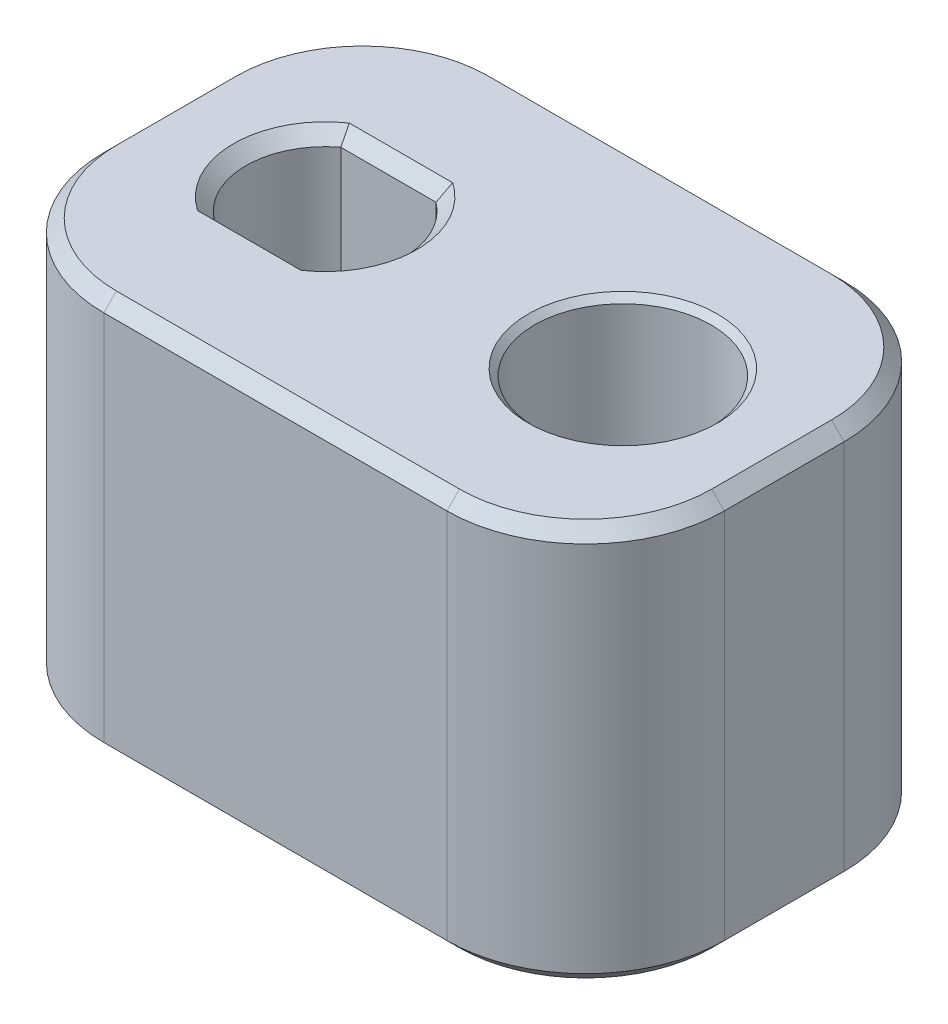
ISO-10303-21;
HEADER;
FILE_DESCRIPTION(('STEP AP214'),'2;1');
FILE_NAME('part.step','',(''),(''),'','','');
FILE_SCHEMA(('AUTOMOTIVE_DESIGN { 1 0 10303 214 1 1 1 1 }'));
ENDSEC;
DATA;
#1=APPLICATION_CONTEXT('core data for automotive mechanical design processes');
#2=APPLICATION_PROTOCOL_DEFINITION('international standard','automotive_design',2000,#1);
#3=PRODUCT_CONTEXT('',#1,'mechanical');
#4=PRODUCT('Part','Part','',(#3));
#5=PRODUCT_RELATED_PRODUCT_CATEGORY('part','',(#4));
#6=PRODUCT_DEFINITION_FORMATION('','',#4);
#7=PRODUCT_DEFINITION_CONTEXT('part definition',#1,'design');
#8=PRODUCT_DEFINITION('design','',#6,#7);
#9=PRODUCT_DEFINITION_SHAPE('','',#8);
#10=(LENGTH_UNIT() NAMED_UNIT(*) SI_UNIT(.MILLI.,.METRE.));
#11=(NAMED_UNIT(*) PLANE_ANGLE_UNIT() SI_UNIT($,.RADIAN.));
#12=(NAMED_UNIT(*) SI_UNIT($,.STERADIAN.) SOLID_ANGLE_UNIT());
#13=UNCERTAINTY_MEASURE_WITH_UNIT(LENGTH_MEASURE(1.E-05),#10,'distance_accuracy_value','');
#14=(GEOMETRIC_REPRESENTATION_CONTEXT(3) GLOBAL_UNCERTAINTY_ASSIGNED_CONTEXT((#13)) GLOBAL_UNIT_ASSIGNED_CONTEXT((#10,
#11,#12)) REPRESENTATION_CONTEXT('',''));
#15=CARTESIAN_POINT('',(0.,0.,0.));
#16=DIRECTION('',(0.,0.,1.));
#17=DIRECTION('',(1.,0.,0.));
#18=AXIS2_PLACEMENT_3D('',#15,#16,#17);
#19=CARTESIAN_POINT('',(12.4968,16.002,-8.001));
#20=DIRECTION('',(0.,-1.,0.));
#21=DIRECTION('',(0.,0.,-1.));
#22=AXIS2_PLACEMENT_3D('',#19,#20,#21);
#23=PLANE('',#22);
#24=CARTESIAN_POINT('',(6.9088,16.002,-2.413));
#25=DIRECTION('',(0.,-1.,0.));
#26=DIRECTION('',(0.,0.,-1.));
#27=AXIS2_PLACEMENT_3D('',#24,#25,#26);
#28=CIRCLE('',#27,5.08000000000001);
#29=CARTESIAN_POINT('',(11.9888,16.002,-2.413));
#30=VERTEX_POINT('',#29);
#31=CARTESIAN_POINT('',(6.9088,16.002,-7.493));
#32=VERTEX_POINT('',#31);
#33=EDGE_CURVE('E58',#30,#32,#28,.F.);
#34=ORIENTED_EDGE('',*,*,#33,.T.);
#35=DIRECTION('',(-1.,0.,0.));
#36=VECTOR('',#35,1.);
#37=CARTESIAN_POINT('',(12.4968,16.002,-7.493));
#38=LINE('',#37,#36);
#39=CARTESIAN_POINT('',(-6.9088,16.002,-7.493));
#40=VERTEX_POINT('',#39);
#41=EDGE_CURVE('E11',#32,#40,#38,.T.);
#42=ORIENTED_EDGE('',*,*,#41,.T.);
#43=CARTESIAN_POINT('',(-6.9088,16.002,-2.413));
#44=DIRECTION('',(0.,-1.,0.));
#45=DIRECTION('',(0.,0.,-1.));
#46=AXIS2_PLACEMENT_3D('',#43,#44,#45);
#47=CIRCLE('',#46,5.08000000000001);
#48=CARTESIAN_POINT('',(-11.9888,16.002,-2.413));
#49=VERTEX_POINT('',#48);
#50=EDGE_CURVE('E43',#40,#49,#47,.F.);
#51=ORIENTED_EDGE('',*,*,#50,.T.);
#52=DIRECTION('',(0.,0.,1.));
#53=VECTOR('',#52,1.);
#54=CARTESIAN_POINT('',(-11.9888,16.002,-8.001));
#55=LINE('',#54,#53);
#56=CARTESIAN_POINT('',(-11.9888,16.002,2.413));
#57=VERTEX_POINT('',#56);
#58=EDGE_CURVE('E404',#49,#57,#55,.T.);
#59=ORIENTED_EDGE('',*,*,#58,.T.);
#60=CARTESIAN_POINT('',(-6.9088,16.002,2.413));
#61=DIRECTION('',(0.,-1.,0.));
#62=DIRECTION('',(0.,0.,-1.));
#63=AXIS2_PLACEMENT_3D('',#60,#61,#62);
#64=CIRCLE('',#63,5.08000000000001);
#65=CARTESIAN_POINT('',(-6.9088,16.002,7.49300000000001));
#66=VERTEX_POINT('',#65);
#67=EDGE_CURVE('E400',#57,#66,#64,.F.);
#68=ORIENTED_EDGE('',*,*,#67,.T.);
#69=DIRECTION('',(1.,0.,0.));
#70=VECTOR('',#69,1.);
#71=CARTESIAN_POINT('',(12.4968,16.002,7.49300000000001));
#72=LINE('',#71,#70);
#73=CARTESIAN_POINT('',(6.9088,16.002,7.49300000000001));
#74=VERTEX_POINT('',#73);
#75=EDGE_CURVE('E396',#66,#74,#72,.T.);
#76=ORIENTED_EDGE('',*,*,#75,.T.);
#77=CARTESIAN_POINT('',(6.90879999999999,16.002,2.413));
#78=DIRECTION('',(0.,-1.,0.));
#79=DIRECTION('',(0.,0.,-1.));
#80=AXIS2_PLACEMENT_3D('',#77,#78,#79);
#81=CIRCLE('',#80,5.08000000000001);
#82=CARTESIAN_POINT('',(11.9888,16.002,2.413));
#83=VERTEX_POINT('',#82);
#84=EDGE_CURVE('E398',#74,#83,#81,.F.);
#85=ORIENTED_EDGE('',*,*,#84,.T.);
#86=DIRECTION('',(0.,0.,-1.));
#87=VECTOR('',#86,1.);
#88=CARTESIAN_POINT('',(11.9888,16.002,-8.001));
#89=LINE('',#88,#87);
#90=EDGE_CURVE('E402',#83,#30,#89,.T.);
#91=ORIENTED_EDGE('',*,*,#90,.T.);
#92=EDGE_LOOP('',(#34,#42,#51,#59,#68,#76,#85,#91));
#93=FACE_BOUND('',#92,.T.);
#94=DIRECTION('',(1.,0.,0.));
#95=VECTOR('',#94,1.);
#96=CARTESIAN_POINT('',(12.4968,16.002,-3.05435));
#97=LINE('',#96,#95);
#98=CARTESIAN_POINT('',(-8.07505964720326,16.002,-3.05435));
#99=VERTEX_POINT('',#98);
#100=CARTESIAN_POINT('',(-3.91374035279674,16.002,-3.05435));
#101=VERTEX_POINT('',#100);
#102=EDGE_CURVE('E239',#99,#101,#97,.T.);
#103=ORIENTED_EDGE('',*,*,#102,.T.);
#104=CARTESIAN_POINT('',(-5.9944,16.002,0.));
#105=DIRECTION('',(0.,-1.,0.));
#106=DIRECTION('',(0.,0.,-1.));
#107=AXIS2_PLACEMENT_3D('',#104,#105,#106);
#108=CIRCLE('',#107,3.6957);
#109=CARTESIAN_POINT('',(-3.91374035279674,16.002,3.05435));
#110=VERTEX_POINT('',#109);
#111=EDGE_CURVE('E251',#101,#110,#108,.T.);
#112=ORIENTED_EDGE('',*,*,#111,.T.);
#113=DIRECTION('',(-1.,0.,0.));
#114=VECTOR('',#113,1.);
#115=CARTESIAN_POINT('',(12.4968,16.002,3.05435));
#116=LINE('',#115,#114);
#117=CARTESIAN_POINT('',(-8.07505964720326,16.002,3.05435000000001));
#118=VERTEX_POINT('',#117);
#119=EDGE_CURVE('E249',#110,#118,#116,.T.);
#120=ORIENTED_EDGE('',*,*,#119,.T.);
#121=CARTESIAN_POINT('',(-5.9944,16.002,0.));
#122=DIRECTION('',(0.,-1.,0.));
#123=DIRECTION('',(0.,0.,-1.));
#124=AXIS2_PLACEMENT_3D('',#121,#122,#123);
#125=CIRCLE('',#124,3.6957);
#126=EDGE_CURVE('E247',#118,#99,#125,.T.);
#127=ORIENTED_EDGE('',*,*,#126,.T.);
#128=EDGE_LOOP('',(#103,#112,#120,#127));
#129=FACE_BOUND('',#128,.T.);
#130=CARTESIAN_POINT('',(5.9944,16.002,0.));
#131=DIRECTION('',(0.,-1.,0.));
#132=DIRECTION('',(0.,0.,-1.));
#133=AXIS2_PLACEMENT_3D('',#130,#131,#132);
#134=CIRCLE('',#133,3.81);
#135=CARTESIAN_POINT('',(5.9944,16.002,-3.81));
#136=VERTEX_POINT('',#135);
#137=EDGE_CURVE('E495',#136,#136,#134,.T.);
#138=ORIENTED_EDGE('',*,*,#137,.T.);
#139=EDGE_LOOP('',(#138));
#140=FACE_BOUND('',#139,.T.);
#141=ADVANCED_FACE('F34',(#93,#129,#140),#23,.F.);
#142=CARTESIAN_POINT('',(12.4968,0.,-8.001));
#143=DIRECTION('',(0.,-1.,0.));
#144=DIRECTION('',(0.,0.,-1.));
#145=AXIS2_PLACEMENT_3D('',#142,#143,#144);
#146=PLANE('',#145);
#147=CARTESIAN_POINT('',(-6.9088,0.,-2.413));
#148=DIRECTION('',(0.,-1.,0.));
#149=DIRECTION('',(0.,0.,-1.));
#150=AXIS2_PLACEMENT_3D('',#147,#148,#149);
#151=CIRCLE('',#150,5.08);
#152=CARTESIAN_POINT('',(-11.9888,0.,-2.413));
#153=VERTEX_POINT('',#152);
#154=CARTESIAN_POINT('',(-6.9088,0.,-7.493));
#155=VERTEX_POINT('',#154);
#156=EDGE_CURVE('E363',#153,#155,#151,.T.);
#157=ORIENTED_EDGE('',*,*,#156,.T.);
#158=DIRECTION('',(1.,0.,0.));
#159=VECTOR('',#158,1.);
#160=CARTESIAN_POINT('',(6.9088,0.,-7.493));
#161=LINE('',#160,#159);
#162=CARTESIAN_POINT('',(6.9088,0.,-7.493));
#163=VERTEX_POINT('',#162);
#164=EDGE_CURVE('E365',#155,#163,#161,.T.);
#165=ORIENTED_EDGE('',*,*,#164,.T.);
#166=CARTESIAN_POINT('',(6.9088,0.,-2.413));
#167=DIRECTION('',(0.,-1.,0.));
#168=DIRECTION('',(0.,0.,-1.));
#169=AXIS2_PLACEMENT_3D('',#166,#167,#168);
#170=CIRCLE('',#169,5.08);
#171=CARTESIAN_POINT('',(11.9888,0.,-2.413));
#172=VERTEX_POINT('',#171);
#173=EDGE_CURVE('E361',#163,#172,#170,.T.);
#174=ORIENTED_EDGE('',*,*,#173,.T.);
#175=DIRECTION('',(0.,0.,1.));
#176=VECTOR('',#175,1.);
#177=CARTESIAN_POINT('',(11.9888,0.,2.413));
#178=LINE('',#177,#176);
#179=CARTESIAN_POINT('',(11.9888,0.,2.413));
#180=VERTEX_POINT('',#179);
#181=EDGE_CURVE('E357',#172,#180,#178,.T.);
#182=ORIENTED_EDGE('',*,*,#181,.T.);
#183=CARTESIAN_POINT('',(6.90879999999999,0.,2.413));
#184=DIRECTION('',(0.,-1.,0.));
#185=DIRECTION('',(0.,0.,-1.));
#186=AXIS2_PLACEMENT_3D('',#183,#184,#185);
#187=CIRCLE('',#186,5.08);
#188=CARTESIAN_POINT('',(6.9088,0.,7.493));
#189=VERTEX_POINT('',#188);
#190=EDGE_CURVE('E353',#180,#189,#187,.T.);
#191=ORIENTED_EDGE('',*,*,#190,.T.);
#192=DIRECTION('',(-1.,0.,0.));
#193=VECTOR('',#192,1.);
#194=CARTESIAN_POINT('',(-6.9088,0.,7.493));
#195=LINE('',#194,#193);
#196=CARTESIAN_POINT('',(-6.9088,0.,7.493));
#197=VERTEX_POINT('',#196);
#198=EDGE_CURVE('E351',#189,#197,#195,.T.);
#199=ORIENTED_EDGE('',*,*,#198,.T.);
#200=CARTESIAN_POINT('',(-6.9088,0.,2.413));
#201=DIRECTION('',(0.,-1.,0.));
#202=DIRECTION('',(0.,0.,-1.));
#203=AXIS2_PLACEMENT_3D('',#200,#201,#202);
#204=CIRCLE('',#203,5.08);
#205=CARTESIAN_POINT('',(-11.9888,0.,2.413));
#206=VERTEX_POINT('',#205);
#207=EDGE_CURVE('E355',#197,#206,#204,.T.);
#208=ORIENTED_EDGE('',*,*,#207,.T.);
#209=DIRECTION('',(0.,0.,-1.));
#210=VECTOR('',#209,1.);
#211=CARTESIAN_POINT('',(-11.9888,0.,-2.413));
#212=LINE('',#211,#210);
#213=EDGE_CURVE('E359',#206,#153,#212,.T.);
#214=ORIENTED_EDGE('',*,*,#213,.T.);
#215=EDGE_LOOP('',(#157,#165,#174,#182,#191,#199,#208,#214));
#216=FACE_BOUND('',#215,.T.);
#217=CARTESIAN_POINT('',(-5.9944,0.,0.));
#218=DIRECTION('',(0.,-1.,0.));
#219=DIRECTION('',(0.,0.,-1.));
#220=AXIS2_PLACEMENT_3D('',#217,#218,#219);
#221=CIRCLE('',#220,3.6957);
#222=CARTESIAN_POINT('',(-8.07505964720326,0.,-3.05435));
#223=VERTEX_POINT('',#222);
#224=CARTESIAN_POINT('',(-8.07505964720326,0.,3.05435));
#225=VERTEX_POINT('',#224);
#226=EDGE_CURVE('E264',#223,#225,#221,.F.);
#227=ORIENTED_EDGE('',*,*,#226,.T.);
#228=DIRECTION('',(1.,0.,0.));
#229=VECTOR('',#228,1.);
#230=CARTESIAN_POINT('',(-4.07671051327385,0.,3.05435));
#231=LINE('',#230,#229);
#232=CARTESIAN_POINT('',(-3.91374035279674,0.,3.05435));
#233=VERTEX_POINT('',#232);
#234=EDGE_CURVE('E268',#225,#233,#231,.T.);
#235=ORIENTED_EDGE('',*,*,#234,.T.);
#236=CARTESIAN_POINT('',(-5.9944,0.,0.));
#237=DIRECTION('',(0.,-1.,0.));
#238=DIRECTION('',(0.,0.,-1.));
#239=AXIS2_PLACEMENT_3D('',#236,#237,#238);
#240=CIRCLE('',#239,3.6957);
#241=CARTESIAN_POINT('',(-3.91374035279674,0.,-3.05435));
#242=VERTEX_POINT('',#241);
#243=EDGE_CURVE('E266',#233,#242,#240,.F.);
#244=ORIENTED_EDGE('',*,*,#243,.T.);
#245=DIRECTION('',(-1.,0.,0.));
#246=VECTOR('',#245,1.);
#247=CARTESIAN_POINT('',(-7.91208948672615,0.,-3.05435));
#248=LINE('',#247,#246);
#249=EDGE_CURVE('E228',#242,#223,#248,.T.);
#250=ORIENTED_EDGE('',*,*,#249,.T.);
#251=EDGE_LOOP('',(#227,#235,#244,#250));
#252=FACE_BOUND('',#251,.T.);
#253=CARTESIAN_POINT('',(5.9944,0.,0.));
#254=DIRECTION('',(0.,-1.,0.));
#255=DIRECTION('',(0.,0.,-1.));
#256=AXIS2_PLACEMENT_3D('',#253,#254,#255);
#257=CIRCLE('',#256,5.6642);
#258=CARTESIAN_POINT('',(5.9944,0.,-5.6642));
#259=VERTEX_POINT('',#258);
#260=EDGE_CURVE('E430',#259,#259,#257,.T.);
#261=ORIENTED_EDGE('',*,*,#260,.F.);
#262=EDGE_LOOP('',(#261));
#263=FACE_BOUND('',#262,.T.);
#264=ADVANCED_FACE('F516',(#216,#252,#263),#146,.T.);
#265=CARTESIAN_POINT('',(12.4968,16.002,8.001));
#266=DIRECTION('',(-1.,0.,0.));
#267=DIRECTION('',(0.,0.,1.));
#268=AXIS2_PLACEMENT_3D('',#265,#266,#267);
#269=PLANE('',#268);
#270=DIRECTION('',(0.,-1.,0.));
#271=VECTOR('',#270,1.);
#272=CARTESIAN_POINT('',(12.4968,16.002,2.413));
#273=LINE('',#272,#271);
#274=CARTESIAN_POINT('',(12.4968,15.494,2.413));
#275=VERTEX_POINT('',#274);
#276=CARTESIAN_POINT('',(12.4968,0.507999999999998,2.413));
#277=VERTEX_POINT('',#276);
#278=EDGE_CURVE('E242',#275,#277,#273,.T.);
#279=ORIENTED_EDGE('',*,*,#278,.T.);
#280=DIRECTION('',(0.,0.,-1.));
#281=VECTOR('',#280,1.);
#282=CARTESIAN_POINT('',(12.4968,0.507999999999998,-2.413));
#283=LINE('',#282,#281);
#284=CARTESIAN_POINT('',(12.4968,0.507999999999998,-2.413));
#285=VERTEX_POINT('',#284);
#286=EDGE_CURVE('E382',#277,#285,#283,.T.);
#287=ORIENTED_EDGE('',*,*,#286,.T.);
#288=DIRECTION('',(0.,-1.,0.));
#289=VECTOR('',#288,1.);
#290=CARTESIAN_POINT('',(12.4968,16.002,-2.413));
#291=LINE('',#290,#289);
#292=CARTESIAN_POINT('',(12.4968,15.494,-2.413));
#293=VERTEX_POINT('',#292);
#294=EDGE_CURVE('E237',#285,#293,#291,.F.);
#295=ORIENTED_EDGE('',*,*,#294,.T.);
#296=DIRECTION('',(0.,0.,1.));
#297=VECTOR('',#296,1.);
#298=CARTESIAN_POINT('',(12.4968,15.494,8.001));
#299=LINE('',#298,#297);
#300=EDGE_CURVE('E380',#293,#275,#299,.T.);
#301=ORIENTED_EDGE('',*,*,#300,.T.);
#302=EDGE_LOOP('',(#279,#287,#295,#301));
#303=FACE_BOUND('',#302,.T.);
#304=ADVANCED_FACE('F518',(#303),#269,.F.);
#305=CARTESIAN_POINT('',(-12.4968,16.002,-8.001));
#306=DIRECTION('',(0.,0.,1.));
#307=DIRECTION('',(1.,0.,0.));
#308=AXIS2_PLACEMENT_3D('',#305,#306,#307);
#309=PLANE('',#308);
#310=DIRECTION('',(0.,-1.,0.));
#311=VECTOR('',#310,1.);
#312=CARTESIAN_POINT('',(6.9088,16.002,-8.001));
#313=LINE('',#312,#311);
#314=CARTESIAN_POINT('',(6.9088,15.494,-8.001));
#315=VERTEX_POINT('',#314);
#316=CARTESIAN_POINT('',(6.9088,0.507999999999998,-8.001));
#317=VERTEX_POINT('',#316);
#318=EDGE_CURVE('E482',#315,#317,#313,.T.);
#319=ORIENTED_EDGE('',*,*,#318,.T.);
#320=DIRECTION('',(-1.,0.,0.));
#321=VECTOR('',#320,1.);
#322=CARTESIAN_POINT('',(-6.9088,0.507999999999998,-8.001));
#323=LINE('',#322,#321);
#324=CARTESIAN_POINT('',(-6.9088,0.507999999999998,-8.001));
#325=VERTEX_POINT('',#324);
#326=EDGE_CURVE('E348',#317,#325,#323,.T.);
#327=ORIENTED_EDGE('',*,*,#326,.T.);
#328=DIRECTION('',(0.,-1.,0.));
#329=VECTOR('',#328,1.);
#330=CARTESIAN_POINT('',(-6.9088,16.002,-8.001));
#331=LINE('',#330,#329);
#332=CARTESIAN_POINT('',(-6.9088,15.494,-8.001));
#333=VERTEX_POINT('',#332);
#334=EDGE_CURVE('E477',#325,#333,#331,.F.);
#335=ORIENTED_EDGE('',*,*,#334,.T.);
#336=DIRECTION('',(1.,0.,0.));
#337=VECTOR('',#336,1.);
#338=CARTESIAN_POINT('',(-12.4968,15.494,-8.001));
#339=LINE('',#338,#337);
#340=EDGE_CURVE('E271',#333,#315,#339,.T.);
#341=ORIENTED_EDGE('',*,*,#340,.T.);
#342=EDGE_LOOP('',(#319,#327,#335,#341));
#343=FACE_BOUND('',#342,.T.);
#344=ADVANCED_FACE('F525',(#343),#309,.F.);
#345=CARTESIAN_POINT('',(-12.4968,16.002,8.001));
#346=DIRECTION('',(1.,0.,0.));
#347=DIRECTION('',(0.,0.,-1.));
#348=AXIS2_PLACEMENT_3D('',#345,#346,#347);
#349=PLANE('',#348);
#350=DIRECTION('',(0.,-1.,0.));
#351=VECTOR('',#350,1.);
#352=CARTESIAN_POINT('',(-12.4968,16.002,-2.413));
#353=LINE('',#352,#351);
#354=CARTESIAN_POINT('',(-12.4968,15.494,-2.413));
#355=VERTEX_POINT('',#354);
#356=CARTESIAN_POINT('',(-12.4968,0.507999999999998,-2.413));
#357=VERTEX_POINT('',#356);
#358=EDGE_CURVE('E485',#355,#357,#353,.T.);
#359=ORIENTED_EDGE('',*,*,#358,.T.);
#360=DIRECTION('',(0.,0.,1.));
#361=VECTOR('',#360,1.);
#362=CARTESIAN_POINT('',(-12.4968,0.507999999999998,2.413));
#363=LINE('',#362,#361);
#364=CARTESIAN_POINT('',(-12.4968,0.507999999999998,2.413));
#365=VERTEX_POINT('',#364);
#366=EDGE_CURVE('E378',#357,#365,#363,.T.);
#367=ORIENTED_EDGE('',*,*,#366,.T.);
#368=DIRECTION('',(0.,-1.,0.));
#369=VECTOR('',#368,1.);
#370=CARTESIAN_POINT('',(-12.4968,16.002,2.413));
#371=LINE('',#370,#369);
#372=CARTESIAN_POINT('',(-12.4968,15.494,2.413));
#373=VERTEX_POINT('',#372);
#374=EDGE_CURVE('E488',#365,#373,#371,.F.);
#375=ORIENTED_EDGE('',*,*,#374,.T.);
#376=DIRECTION('',(0.,0.,-1.));
#377=VECTOR('',#376,1.);
#378=CARTESIAN_POINT('',(-12.4968,15.494,8.001));
#379=LINE('',#378,#377);
#380=EDGE_CURVE('E376',#373,#355,#379,.T.);
#381=ORIENTED_EDGE('',*,*,#380,.T.);
#382=EDGE_LOOP('',(#359,#367,#375,#381));
#383=FACE_BOUND('',#382,.T.);
#384=ADVANCED_FACE('F535',(#383),#349,.F.);
#385=CARTESIAN_POINT('',(-12.4968,16.002,8.001));
#386=DIRECTION('',(0.,0.,-1.));
#387=DIRECTION('',(-1.,0.,0.));
#388=AXIS2_PLACEMENT_3D('',#385,#386,#387);
#389=PLANE('',#388);
#390=DIRECTION('',(0.,-1.,0.));
#391=VECTOR('',#390,1.);
#392=CARTESIAN_POINT('',(-6.9088,16.002,8.001));
#393=LINE('',#392,#391);
#394=CARTESIAN_POINT('',(-6.9088,15.494,8.001));
#395=VERTEX_POINT('',#394);
#396=CARTESIAN_POINT('',(-6.9088,0.507999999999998,8.001));
#397=VERTEX_POINT('',#396);
#398=EDGE_CURVE('E466',#395,#397,#393,.T.);
#399=ORIENTED_EDGE('',*,*,#398,.T.);
#400=DIRECTION('',(1.,0.,0.));
#401=VECTOR('',#400,1.);
#402=CARTESIAN_POINT('',(6.9088,0.507999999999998,8.001));
#403=LINE('',#402,#401);
#404=CARTESIAN_POINT('',(6.9088,0.507999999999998,8.001));
#405=VERTEX_POINT('',#404);
#406=EDGE_CURVE('E394',#397,#405,#403,.T.);
#407=ORIENTED_EDGE('',*,*,#406,.T.);
#408=DIRECTION('',(0.,-1.,0.));
#409=VECTOR('',#408,1.);
#410=CARTESIAN_POINT('',(6.9088,16.002,8.001));
#411=LINE('',#410,#409);
#412=CARTESIAN_POINT('',(6.9088,15.494,8.001));
#413=VERTEX_POINT('',#412);
#414=EDGE_CURVE('E469',#405,#413,#411,.F.);
#415=ORIENTED_EDGE('',*,*,#414,.T.);
#416=DIRECTION('',(-1.,0.,0.));
#417=VECTOR('',#416,1.);
#418=CARTESIAN_POINT('',(-12.4968,15.494,8.001));
#419=LINE('',#418,#417);
#420=EDGE_CURVE('E392',#413,#395,#419,.T.);
#421=ORIENTED_EDGE('',*,*,#420,.T.);
#422=EDGE_LOOP('',(#399,#407,#415,#421));
#423=FACE_BOUND('',#422,.T.);
#424=ADVANCED_FACE('F465',(#423),#389,.F.);
#425=CARTESIAN_POINT('',(-6.9088,16.002,-2.413));
#426=DIRECTION('',(0.,-1.,0.));
#427=DIRECTION('',(0.,0.,-1.));
#428=AXIS2_PLACEMENT_3D('',#425,#426,#427);
#429=CYLINDRICAL_SURFACE('',#428,5.588);
#430=ORIENTED_EDGE('',*,*,#334,.F.);
#431=CARTESIAN_POINT('',(-6.9088,0.507999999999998,-2.413));
#432=DIRECTION('',(0.,-1.,0.));
#433=DIRECTION('',(0.,0.,-1.));
#434=AXIS2_PLACEMENT_3D('',#431,#432,#433);
#435=CIRCLE('',#434,5.588);
#436=EDGE_CURVE('E370',#325,#357,#435,.F.);
#437=ORIENTED_EDGE('',*,*,#436,.T.);
#438=ORIENTED_EDGE('',*,*,#358,.F.);
#439=CARTESIAN_POINT('',(-6.9088,15.494,-2.413));
#440=DIRECTION('',(0.,-1.,0.));
#441=DIRECTION('',(0.,0.,-1.));
#442=AXIS2_PLACEMENT_3D('',#439,#440,#441);
#443=CIRCLE('',#442,5.588);
#444=EDGE_CURVE('E368',#355,#333,#443,.T.);
#445=ORIENTED_EDGE('',*,*,#444,.T.);
#446=EDGE_LOOP('',(#430,#437,#438,#445));
#447=FACE_BOUND('',#446,.T.);
#448=ADVANCED_FACE('F534',(#447),#429,.T.);
#449=CARTESIAN_POINT('',(-6.9088,16.002,2.413));
#450=DIRECTION('',(0.,-1.,0.));
#451=DIRECTION('',(0.,0.,-1.));
#452=AXIS2_PLACEMENT_3D('',#449,#450,#451);
#453=CYLINDRICAL_SURFACE('',#452,5.588);
#454=ORIENTED_EDGE('',*,*,#374,.F.);
#455=CARTESIAN_POINT('',(-6.9088,0.507999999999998,2.413));
#456=DIRECTION('',(0.,-1.,0.));
#457=DIRECTION('',(0.,0.,-1.));
#458=AXIS2_PLACEMENT_3D('',#455,#456,#457);
#459=CIRCLE('',#458,5.588);
#460=EDGE_CURVE('E386',#365,#397,#459,.F.);
#461=ORIENTED_EDGE('',*,*,#460,.T.);
#462=ORIENTED_EDGE('',*,*,#398,.F.);
#463=CARTESIAN_POINT('',(-6.9088,15.494,2.413));
#464=DIRECTION('',(0.,-1.,0.));
#465=DIRECTION('',(0.,0.,-1.));
#466=AXIS2_PLACEMENT_3D('',#463,#464,#465);
#467=CIRCLE('',#466,5.588);
#468=EDGE_CURVE('E384',#395,#373,#467,.T.);
#469=ORIENTED_EDGE('',*,*,#468,.T.);
#470=EDGE_LOOP('',(#454,#461,#462,#469));
#471=FACE_BOUND('',#470,.T.);
#472=ADVANCED_FACE('F472',(#471),#453,.T.);
#473=CARTESIAN_POINT('',(6.9088,16.002,-2.413));
#474=DIRECTION('',(0.,-1.,0.));
#475=DIRECTION('',(0.,0.,-1.));
#476=AXIS2_PLACEMENT_3D('',#473,#474,#475);
#477=CYLINDRICAL_SURFACE('',#476,5.588);
#478=ORIENTED_EDGE('',*,*,#294,.F.);
#479=CARTESIAN_POINT('',(6.9088,0.507999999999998,-2.413));
#480=DIRECTION('',(0.,-1.,0.));
#481=DIRECTION('',(0.,0.,-1.));
#482=AXIS2_PLACEMENT_3D('',#479,#480,#481);
#483=CIRCLE('',#482,5.588);
#484=EDGE_CURVE('E374',#285,#317,#483,.F.);
#485=ORIENTED_EDGE('',*,*,#484,.T.);
#486=ORIENTED_EDGE('',*,*,#318,.F.);
#487=CARTESIAN_POINT('',(6.9088,15.494,-2.413));
#488=DIRECTION('',(0.,-1.,0.));
#489=DIRECTION('',(0.,0.,-1.));
#490=AXIS2_PLACEMENT_3D('',#487,#488,#489);
#491=CIRCLE('',#490,5.588);
#492=EDGE_CURVE('E372',#315,#293,#491,.T.);
#493=ORIENTED_EDGE('',*,*,#492,.T.);
#494=EDGE_LOOP('',(#478,#485,#486,#493));
#495=FACE_BOUND('',#494,.T.);
#496=ADVANCED_FACE('F547',(#495),#477,.T.);
#497=CARTESIAN_POINT('',(6.90879999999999,16.002,2.413));
#498=DIRECTION('',(0.,-1.,0.));
#499=DIRECTION('',(0.,0.,-1.));
#500=AXIS2_PLACEMENT_3D('',#497,#498,#499);
#501=CYLINDRICAL_SURFACE('',#500,5.588);
#502=ORIENTED_EDGE('',*,*,#414,.F.);
#503=CARTESIAN_POINT('',(6.90879999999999,0.507999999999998,2.413));
#504=DIRECTION('',(0.,-1.,0.));
#505=DIRECTION('',(0.,0.,-1.));
#506=AXIS2_PLACEMENT_3D('',#503,#504,#505);
#507=CIRCLE('',#506,5.588);
#508=EDGE_CURVE('E390',#405,#277,#507,.F.);
#509=ORIENTED_EDGE('',*,*,#508,.T.);
#510=ORIENTED_EDGE('',*,*,#278,.F.);
#511=CARTESIAN_POINT('',(6.90879999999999,15.494,2.413));
#512=DIRECTION('',(0.,-1.,0.));
#513=DIRECTION('',(0.,0.,-1.));
#514=AXIS2_PLACEMENT_3D('',#511,#512,#513);
#515=CIRCLE('',#514,5.588);
#516=EDGE_CURVE('E388',#275,#413,#515,.T.);
#517=ORIENTED_EDGE('',*,*,#516,.T.);
#518=EDGE_LOOP('',(#502,#509,#510,#517));
#519=FACE_BOUND('',#518,.T.);
#520=ADVANCED_FACE('F549',(#519),#501,.T.);
#521=CARTESIAN_POINT('',(-5.9944,0.,0.));
#522=DIRECTION('',(0.,1.,0.));
#523=DIRECTION('',(0.,0.,1.));
#524=AXIS2_PLACEMENT_3D('',#521,#522,#523);
#525=CYLINDRICAL_SURFACE('',#524,3.1877);
#526=DIRECTION('',(0.,1.,0.));
#527=VECTOR('',#526,1.);
#528=CARTESIAN_POINT('',(-7.91208948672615,0.,-2.54635));
#529=LINE('',#528,#527);
#530=CARTESIAN_POINT('',(-7.91208948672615,0.508000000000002,-2.54635));
#531=VERTEX_POINT('',#530);
#532=CARTESIAN_POINT('',(-7.91208948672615,15.494,-2.54635));
#533=VERTEX_POINT('',#532);
#534=EDGE_CURVE('E205',#531,#533,#529,.T.);
#535=ORIENTED_EDGE('',*,*,#534,.T.);
#536=CARTESIAN_POINT('',(-5.9944,15.494,0.));
#537=DIRECTION('',(0.,-1.,0.));
#538=DIRECTION('',(0.,0.,-1.));
#539=AXIS2_PLACEMENT_3D('',#536,#537,#538);
#540=CIRCLE('',#539,3.1877);
#541=CARTESIAN_POINT('',(-7.91208948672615,15.494,2.54635));
#542=VERTEX_POINT('',#541);
#543=EDGE_CURVE('E211',#533,#542,#540,.F.);
#544=ORIENTED_EDGE('',*,*,#543,.T.);
#545=DIRECTION('',(0.,1.,0.));
#546=VECTOR('',#545,1.);
#547=CARTESIAN_POINT('',(-7.91208948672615,0.,2.54635));
#548=LINE('',#547,#546);
#549=CARTESIAN_POINT('',(-7.91208948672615,0.508000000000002,2.54635));
#550=VERTEX_POINT('',#549);
#551=EDGE_CURVE('E490',#550,#542,#548,.T.);
#552=ORIENTED_EDGE('',*,*,#551,.F.);
#553=CARTESIAN_POINT('',(-5.9944,0.508000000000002,0.));
#554=DIRECTION('',(0.,-1.,0.));
#555=DIRECTION('',(0.,0.,-1.));
#556=AXIS2_PLACEMENT_3D('',#553,#554,#555);
#557=CIRCLE('',#556,3.1877);
#558=EDGE_CURVE('E259',#550,#531,#557,.T.);
#559=ORIENTED_EDGE('',*,*,#558,.T.);
#560=EDGE_LOOP('',(#535,#544,#552,#559));
#561=FACE_BOUND('',#560,.T.);
#562=ADVANCED_FACE('F552',(#561),#525,.F.);
#563=CARTESIAN_POINT('',(-7.91208948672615,0.,-2.54635));
#564=DIRECTION('',(0.,0.,-1.));
#565=DIRECTION('',(-1.,0.,0.));
#566=AXIS2_PLACEMENT_3D('',#563,#564,#565);
#567=PLANE('',#566);
#568=DIRECTION('',(0.,1.,0.));
#569=VECTOR('',#568,1.);
#570=CARTESIAN_POINT('',(-4.07671051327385,0.,-2.54635));
#571=LINE('',#570,#569);
#572=CARTESIAN_POINT('',(-4.07671051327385,0.508000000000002,-2.54635));
#573=VERTEX_POINT('',#572);
#574=CARTESIAN_POINT('',(-4.07671051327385,15.494,-2.54635));
#575=VERTEX_POINT('',#574);
#576=EDGE_CURVE('E203',#573,#575,#571,.T.);
#577=ORIENTED_EDGE('',*,*,#576,.T.);
#578=DIRECTION('',(-1.,0.,0.));
#579=VECTOR('',#578,1.);
#580=CARTESIAN_POINT('',(-7.91208948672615,15.494,-2.54635));
#581=LINE('',#580,#579);
#582=EDGE_CURVE('E210',#575,#533,#581,.T.);
#583=ORIENTED_EDGE('',*,*,#582,.T.);
#584=ORIENTED_EDGE('',*,*,#534,.F.);
#585=DIRECTION('',(1.,0.,0.));
#586=VECTOR('',#585,1.);
#587=CARTESIAN_POINT('',(-4.07671051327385,0.508000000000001,-2.54635));
#588=LINE('',#587,#586);
#589=EDGE_CURVE('E200',#531,#573,#588,.T.);
#590=ORIENTED_EDGE('',*,*,#589,.T.);
#591=EDGE_LOOP('',(#577,#583,#584,#590));
#592=FACE_BOUND('',#591,.T.);
#593=ADVANCED_FACE('F202',(#592),#567,.F.);
#594=CARTESIAN_POINT('',(-5.9944,0.,0.));
#595=DIRECTION('',(0.,1.,0.));
#596=DIRECTION('',(0.,0.,1.));
#597=AXIS2_PLACEMENT_3D('',#594,#595,#596);
#598=CYLINDRICAL_SURFACE('',#597,3.1877);
#599=DIRECTION('',(0.,1.,0.));
#600=VECTOR('',#599,1.);
#601=CARTESIAN_POINT('',(-4.07671051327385,0.,2.54635));
#602=LINE('',#601,#600);
#603=CARTESIAN_POINT('',(-4.07671051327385,0.508000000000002,2.54635));
#604=VERTEX_POINT('',#603);
#605=CARTESIAN_POINT('',(-4.07671051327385,15.494,2.54635));
#606=VERTEX_POINT('',#605);
#607=EDGE_CURVE('E222',#604,#606,#602,.T.);
#608=ORIENTED_EDGE('',*,*,#607,.T.);
#609=CARTESIAN_POINT('',(-5.9944,15.494,0.));
#610=DIRECTION('',(0.,-1.,0.));
#611=DIRECTION('',(0.,0.,-1.));
#612=AXIS2_PLACEMENT_3D('',#609,#610,#611);
#613=CIRCLE('',#612,3.1877);
#614=EDGE_CURVE('E221',#606,#575,#613,.F.);
#615=ORIENTED_EDGE('',*,*,#614,.T.);
#616=ORIENTED_EDGE('',*,*,#576,.F.);
#617=CARTESIAN_POINT('',(-5.9944,0.508000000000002,0.));
#618=DIRECTION('',(0.,-1.,0.));
#619=DIRECTION('',(0.,0.,-1.));
#620=AXIS2_PLACEMENT_3D('',#617,#618,#619);
#621=CIRCLE('',#620,3.1877);
#622=EDGE_CURVE('E218',#573,#604,#621,.T.);
#623=ORIENTED_EDGE('',*,*,#622,.T.);
#624=EDGE_LOOP('',(#608,#615,#616,#623));
#625=FACE_BOUND('',#624,.T.);
#626=ADVANCED_FACE('F216',(#625),#598,.F.);
#627=CARTESIAN_POINT('',(-7.91208948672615,0.,2.54635));
#628=DIRECTION('',(0.,0.,1.));
#629=DIRECTION('',(1.,0.,0.));
#630=AXIS2_PLACEMENT_3D('',#627,#628,#629);
#631=PLANE('',#630);
#632=ORIENTED_EDGE('',*,*,#551,.T.);
#633=DIRECTION('',(1.,0.,0.));
#634=VECTOR('',#633,1.);
#635=CARTESIAN_POINT('',(-7.91208948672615,15.494,2.54635));
#636=LINE('',#635,#634);
#637=EDGE_CURVE('E257',#542,#606,#636,.T.);
#638=ORIENTED_EDGE('',*,*,#637,.T.);
#639=ORIENTED_EDGE('',*,*,#607,.F.);
#640=DIRECTION('',(-1.,0.,0.));
#641=VECTOR('',#640,1.);
#642=CARTESIAN_POINT('',(-7.91208948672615,0.508000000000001,2.54635));
#643=LINE('',#642,#641);
#644=EDGE_CURVE('E254',#604,#550,#643,.T.);
#645=ORIENTED_EDGE('',*,*,#644,.T.);
#646=EDGE_LOOP('',(#632,#638,#639,#645));
#647=FACE_BOUND('',#646,.T.);
#648=ADVANCED_FACE('F311',(#647),#631,.F.);
#649=CARTESIAN_POINT('',(-5.9944,15.494,0.));
#650=DIRECTION('',(0.,1.,0.));
#651=DIRECTION('',(0.,0.,1.));
#652=AXIS2_PLACEMENT_3D('',#649,#650,#651);
#653=CONICAL_SURFACE('',#652,3.1877,0.785398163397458);
#654=CARTESIAN_POINT('',(-8.07505964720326,16.002,-3.05435));
#655=CARTESIAN_POINT('',(-8.04895050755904,15.9171646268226,-2.96951462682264));
#656=CARTESIAN_POINT('',(-8.02231511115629,15.8324136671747,-2.8847636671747));
#657=CARTESIAN_POINT('',(-7.96799172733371,15.6630803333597,-2.71543033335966));
#658=CARTESIAN_POINT('',(-7.94030373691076,15.5784979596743,-2.63084795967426));
#659=CARTESIAN_POINT('',(-7.91208948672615,15.494,-2.54635));
#660=B_SPLINE_CURVE_WITH_KNOTS('',3,(#654,#655,#656,#657,#658,#659),.UNSPECIFIED.,.F.,.F.,(4,2,
4),(0.,0.368339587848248,0.736680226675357),.UNSPECIFIED.);
#661=EDGE_CURVE('E296',#99,#533,#660,.T.);
#662=ORIENTED_EDGE('',*,*,#661,.F.);
#663=ORIENTED_EDGE('',*,*,#126,.F.);
#664=CARTESIAN_POINT('',(-8.07505964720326,16.002,3.05435000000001));
#665=CARTESIAN_POINT('',(-8.04895050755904,15.9171646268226,2.96951462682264));
#666=CARTESIAN_POINT('',(-8.02231511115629,15.8324136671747,2.8847636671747));
#667=CARTESIAN_POINT('',(-7.96799172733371,15.6630803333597,2.71543033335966));
#668=CARTESIAN_POINT('',(-7.94030373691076,15.5784979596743,2.63084795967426));
#669=CARTESIAN_POINT('',(-7.91208948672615,15.494,2.54635));
#670=B_SPLINE_CURVE_WITH_KNOTS('',3,(#664,#665,#666,#667,#668,#669),.UNSPECIFIED.,.F.,.F.,(4,2,
4),(0.,0.368339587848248,0.736680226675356),.UNSPECIFIED.);
#671=EDGE_CURVE('E302',#542,#118,#670,.F.);
#672=ORIENTED_EDGE('',*,*,#671,.F.);
#673=ORIENTED_EDGE('',*,*,#543,.F.);
#674=EDGE_LOOP('',(#662,#663,#672,#673));
#675=FACE_BOUND('',#674,.T.);
#676=ADVANCED_FACE('F307',(#675),#653,.F.);
#677=CARTESIAN_POINT('',(-7.91208948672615,15.494,2.54635));
#678=DIRECTION('',(0.,-0.707106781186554,0.707106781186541));
#679=DIRECTION('',(0.,-0.707106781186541,-0.707106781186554));
#680=AXIS2_PLACEMENT_3D('',#677,#678,#679);
#681=PLANE('',#680);
#682=ORIENTED_EDGE('',*,*,#671,.T.);
#683=ORIENTED_EDGE('',*,*,#119,.F.);
#684=CARTESIAN_POINT('',(-3.91374035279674,16.002,3.05435));
#685=CARTESIAN_POINT('',(-3.93984949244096,15.9171646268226,2.96951462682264));
#686=CARTESIAN_POINT('',(-3.96648488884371,15.8324136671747,2.8847636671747));
#687=CARTESIAN_POINT('',(-4.02080827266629,15.6630803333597,2.71543033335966));
#688=CARTESIAN_POINT('',(-4.04849626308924,15.5784979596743,2.63084795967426));
#689=CARTESIAN_POINT('',(-4.07671051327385,15.494,2.54635));
#690=B_SPLINE_CURVE_WITH_KNOTS('',3,(#684,#685,#686,#687,#688,#689),.UNSPECIFIED.,.F.,.F.,(4,2,
4),(0.,0.368339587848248,0.736680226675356),.UNSPECIFIED.);
#691=EDGE_CURVE('E279',#606,#110,#690,.F.);
#692=ORIENTED_EDGE('',*,*,#691,.F.);
#693=ORIENTED_EDGE('',*,*,#637,.F.);
#694=EDGE_LOOP('',(#682,#683,#692,#693));
#695=FACE_BOUND('',#694,.T.);
#696=ADVANCED_FACE('F291',(#695),#681,.F.);
#697=CARTESIAN_POINT('',(-7.91208948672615,15.494,-2.54635));
#698=DIRECTION('',(0.,-0.707106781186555,-0.70710678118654));
#699=DIRECTION('',(0.,0.70710678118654,-0.707106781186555));
#700=AXIS2_PLACEMENT_3D('',#697,#698,#699);
#701=PLANE('',#700);
#702=ORIENTED_EDGE('',*,*,#661,.T.);
#703=ORIENTED_EDGE('',*,*,#582,.F.);
#704=CARTESIAN_POINT('',(-4.07671051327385,15.494,-2.54635));
#705=CARTESIAN_POINT('',(-4.04849626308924,15.5784979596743,-2.63084795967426));
#706=CARTESIAN_POINT('',(-4.02080827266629,15.6630803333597,-2.71543033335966));
#707=CARTESIAN_POINT('',(-3.96648488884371,15.8324136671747,-2.8847636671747));
#708=CARTESIAN_POINT('',(-3.93984949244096,15.9171646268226,-2.96951462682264));
#709=CARTESIAN_POINT('',(-3.91374035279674,16.002,-3.05435));
#710=B_SPLINE_CURVE_WITH_KNOTS('',3,(#704,#705,#706,#707,#708,#709),.UNSPECIFIED.,.F.,.F.,(4,2,
4),(0.,0.368340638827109,0.736680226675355),.UNSPECIFIED.);
#711=EDGE_CURVE('E272',#101,#575,#710,.F.);
#712=ORIENTED_EDGE('',*,*,#711,.F.);
#713=ORIENTED_EDGE('',*,*,#102,.F.);
#714=EDGE_LOOP('',(#702,#703,#712,#713));
#715=FACE_BOUND('',#714,.T.);
#716=ADVANCED_FACE('F288',(#715),#701,.F.);
#717=CARTESIAN_POINT('',(-5.9944,15.494,0.));
#718=DIRECTION('',(0.,1.,0.));
#719=DIRECTION('',(0.,0.,1.));
#720=AXIS2_PLACEMENT_3D('',#717,#718,#719);
#721=CONICAL_SURFACE('',#720,3.1877,0.785398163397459);
#722=ORIENTED_EDGE('',*,*,#691,.T.);
#723=ORIENTED_EDGE('',*,*,#111,.F.);
#724=ORIENTED_EDGE('',*,*,#711,.T.);
#725=ORIENTED_EDGE('',*,*,#614,.F.);
#726=EDGE_LOOP('',(#722,#723,#724,#725));
#727=FACE_BOUND('',#726,.T.);
#728=ADVANCED_FACE('F285',(#727),#721,.F.);
#729=CARTESIAN_POINT('',(12.4968,0.,-3.05435));
#730=DIRECTION('',(0.,-0.707106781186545,0.70710678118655));
#731=DIRECTION('',(0.,-0.70710678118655,-0.707106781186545));
#732=AXIS2_PLACEMENT_3D('',#729,#730,#731);
#733=PLANE('',#732);
#734=CARTESIAN_POINT('',(-3.91374035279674,0.,-3.05435));
#735=CARTESIAN_POINT('',(-3.93984949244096,0.0848353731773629,-2.96951462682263));
#736=CARTESIAN_POINT('',(-3.96648488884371,0.1695863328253,-2.8847636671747));
#737=CARTESIAN_POINT('',(-4.02080827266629,0.338919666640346,-2.71543033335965));
#738=CARTESIAN_POINT('',(-4.04849626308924,0.423502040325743,-2.63084795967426));
#739=CARTESIAN_POINT('',(-4.07671051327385,0.508000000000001,-2.54635));
#740=B_SPLINE_CURVE_WITH_KNOTS('',3,(#734,#735,#736,#737,#738,#739),.UNSPECIFIED.,.F.,.F.,(4,2,
4),(0.,0.368339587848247,0.736680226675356),.UNSPECIFIED.);
#741=EDGE_CURVE('E226',#573,#242,#740,.F.);
#742=ORIENTED_EDGE('',*,*,#741,.F.);
#743=ORIENTED_EDGE('',*,*,#589,.F.);
#744=CARTESIAN_POINT('',(-7.91208948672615,0.508000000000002,-2.54635));
#745=CARTESIAN_POINT('',(-7.94030373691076,0.423502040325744,-2.63084795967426));
#746=CARTESIAN_POINT('',(-7.96799172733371,0.338919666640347,-2.71543033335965));
#747=CARTESIAN_POINT('',(-8.02231511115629,0.1695863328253,-2.8847636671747));
#748=CARTESIAN_POINT('',(-8.04895050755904,0.0848353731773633,-2.96951462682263));
#749=CARTESIAN_POINT('',(-8.07505964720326,0.,-3.05435));
#750=B_SPLINE_CURVE_WITH_KNOTS('',3,(#744,#745,#746,#747,#748,#749),.UNSPECIFIED.,.F.,.F.,(4,2,
4),(0.,0.368340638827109,0.736680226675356),.UNSPECIFIED.);
#751=EDGE_CURVE('E231',#223,#531,#750,.F.);
#752=ORIENTED_EDGE('',*,*,#751,.F.);
#753=ORIENTED_EDGE('',*,*,#249,.F.);
#754=EDGE_LOOP('',(#742,#743,#752,#753));
#755=FACE_BOUND('',#754,.T.);
#756=ADVANCED_FACE('F227',(#755),#733,.T.);
#757=CARTESIAN_POINT('',(-5.9944,0.,0.));
#758=DIRECTION('',(0.,-1.,0.));
#759=DIRECTION('',(0.,0.,-1.));
#760=AXIS2_PLACEMENT_3D('',#757,#758,#759);
#761=CONICAL_SURFACE('',#760,3.6957,0.785398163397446);
#762=ORIENTED_EDGE('',*,*,#751,.T.);
#763=ORIENTED_EDGE('',*,*,#558,.F.);
#764=CARTESIAN_POINT('',(-7.91208948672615,0.508000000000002,2.54635));
#765=CARTESIAN_POINT('',(-7.94030373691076,0.423502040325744,2.63084795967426));
#766=CARTESIAN_POINT('',(-7.96799172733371,0.338919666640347,2.71543033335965));
#767=CARTESIAN_POINT('',(-8.02231511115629,0.1695863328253,2.8847636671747));
#768=CARTESIAN_POINT('',(-8.04895050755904,0.0848353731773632,2.96951462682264));
#769=CARTESIAN_POINT('',(-8.07505964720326,0.,3.05435));
#770=B_SPLINE_CURVE_WITH_KNOTS('',3,(#764,#765,#766,#767,#768,#769),.UNSPECIFIED.,.F.,.F.,(4,2,
4),(0.,0.368340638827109,0.736680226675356),.UNSPECIFIED.);
#771=EDGE_CURVE('E232',#225,#550,#770,.F.);
#772=ORIENTED_EDGE('',*,*,#771,.F.);
#773=ORIENTED_EDGE('',*,*,#226,.F.);
#774=EDGE_LOOP('',(#762,#763,#772,#773));
#775=FACE_BOUND('',#774,.T.);
#776=ADVANCED_FACE('F335',(#775),#761,.F.);
#777=CARTESIAN_POINT('',(-5.9944,0.,0.));
#778=DIRECTION('',(0.,-1.,0.));
#779=DIRECTION('',(0.,0.,-1.));
#780=AXIS2_PLACEMENT_3D('',#777,#778,#779);
#781=CONICAL_SURFACE('',#780,3.6957,0.785398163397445);
#782=ORIENTED_EDGE('',*,*,#741,.T.);
#783=ORIENTED_EDGE('',*,*,#243,.F.);
#784=CARTESIAN_POINT('',(-3.91374035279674,0.,3.05435));
#785=CARTESIAN_POINT('',(-3.93984949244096,0.0848353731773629,2.96951462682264));
#786=CARTESIAN_POINT('',(-3.96648488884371,0.1695863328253,2.8847636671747));
#787=CARTESIAN_POINT('',(-4.02080827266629,0.338919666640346,2.71543033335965));
#788=CARTESIAN_POINT('',(-4.04849626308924,0.423502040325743,2.63084795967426));
#789=CARTESIAN_POINT('',(-4.07671051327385,0.508000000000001,2.54635));
#790=B_SPLINE_CURVE_WITH_KNOTS('',3,(#784,#785,#786,#787,#788,#789),.UNSPECIFIED.,.F.,.F.,(4,2,
4),(0.,0.368339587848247,0.736680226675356),.UNSPECIFIED.);
#791=EDGE_CURVE('E236',#604,#233,#790,.F.);
#792=ORIENTED_EDGE('',*,*,#791,.F.);
#793=ORIENTED_EDGE('',*,*,#622,.F.);
#794=EDGE_LOOP('',(#782,#783,#792,#793));
#795=FACE_BOUND('',#794,.T.);
#796=ADVANCED_FACE('F235',(#795),#781,.F.);
#797=CARTESIAN_POINT('',(12.4968,0.,3.05434999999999));
#798=DIRECTION('',(0.,-0.707106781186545,-0.70710678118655));
#799=DIRECTION('',(0.,0.70710678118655,-0.707106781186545));
#800=AXIS2_PLACEMENT_3D('',#797,#798,#799);
#801=PLANE('',#800);
#802=ORIENTED_EDGE('',*,*,#771,.T.);
#803=ORIENTED_EDGE('',*,*,#644,.F.);
#804=ORIENTED_EDGE('',*,*,#791,.T.);
#805=ORIENTED_EDGE('',*,*,#234,.F.);
#806=EDGE_LOOP('',(#802,#803,#804,#805));
#807=FACE_BOUND('',#806,.T.);
#808=ADVANCED_FACE('F313',(#807),#801,.T.);
#809=CARTESIAN_POINT('',(5.9944,16.002,0.));
#810=DIRECTION('',(0.,1.,0.));
#811=DIRECTION('',(0.,0.,1.));
#812=AXIS2_PLACEMENT_3D('',#809,#810,#811);
#813=CONICAL_SURFACE('',#812,3.81,0.785398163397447);
#814=CARTESIAN_POINT('',(5.9944,15.748,0.));
#815=DIRECTION('',(0.,-1.,0.));
#816=DIRECTION('',(0.,0.,-1.));
#817=AXIS2_PLACEMENT_3D('',#814,#815,#816);
#818=CIRCLE('',#817,3.556);
#819=CARTESIAN_POINT('',(5.9944,15.748,-3.556));
#820=VERTEX_POINT('',#819);
#821=EDGE_CURVE('E498',#820,#820,#818,.T.);
#822=ORIENTED_EDGE('',*,*,#821,.T.);
#823=EDGE_LOOP('',(#822));
#824=FACE_BOUND('',#823,.T.);
#825=ORIENTED_EDGE('',*,*,#137,.F.);
#826=EDGE_LOOP('',(#825));
#827=FACE_BOUND('',#826,.T.);
#828=ADVANCED_FACE('F318',(#824,#827),#813,.F.);
#829=CARTESIAN_POINT('',(5.9944,-4.12040578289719,0.));
#830=DIRECTION('',(0.,-1.,0.));
#831=DIRECTION('',(0.,0.,-1.));
#832=AXIS2_PLACEMENT_3D('',#829,#830,#831);
#833=CYLINDRICAL_SURFACE('',#832,3.556);
#834=CARTESIAN_POINT('',(5.9944,7.112,0.));
#835=DIRECTION('',(0.,-1.,0.));
#836=DIRECTION('',(0.,0.,-1.));
#837=AXIS2_PLACEMENT_3D('',#834,#835,#836);
#838=CIRCLE('',#837,3.556);
#839=CARTESIAN_POINT('',(5.9944,7.112,-3.556));
#840=VERTEX_POINT('',#839);
#841=EDGE_CURVE('E501',#840,#840,#838,.T.);
#842=ORIENTED_EDGE('',*,*,#841,.T.);
#843=EDGE_LOOP('',(#842));
#844=FACE_BOUND('',#843,.T.);
#845=ORIENTED_EDGE('',*,*,#821,.F.);
#846=EDGE_LOOP('',(#845));
#847=FACE_BOUND('',#846,.T.);
#848=ADVANCED_FACE('F597',(#844,#847),#833,.F.);
#849=CARTESIAN_POINT('',(2.4384,7.112,0.));
#850=DIRECTION('',(0.,-1.,0.));
#851=DIRECTION('',(0.,0.,-1.));
#852=AXIS2_PLACEMENT_3D('',#849,#850,#851);
#853=PLANE('',#852);
#854=CARTESIAN_POINT('',(5.9944,7.112,0.));
#855=DIRECTION('',(0.,-1.,0.));
#856=DIRECTION('',(0.,0.,-1.));
#857=AXIS2_PLACEMENT_3D('',#854,#855,#856);
#858=CIRCLE('',#857,5.1562);
#859=CARTESIAN_POINT('',(5.9944,7.112,-5.1562));
#860=VERTEX_POINT('',#859);
#861=EDGE_CURVE('E504',#860,#860,#858,.T.);
#862=ORIENTED_EDGE('',*,*,#861,.T.);
#863=EDGE_LOOP('',(#862));
#864=FACE_BOUND('',#863,.T.);
#865=ORIENTED_EDGE('',*,*,#841,.F.);
#866=EDGE_LOOP('',(#865));
#867=FACE_BOUND('',#866,.T.);
#868=ADVANCED_FACE('F603',(#864,#867),#853,.T.);
#869=CARTESIAN_POINT('',(5.9944,-4.12040578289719,0.));
#870=DIRECTION('',(0.,-1.,0.));
#871=DIRECTION('',(0.,0.,-1.));
#872=AXIS2_PLACEMENT_3D('',#869,#870,#871);
#873=CYLINDRICAL_SURFACE('',#872,5.1562);
#874=CARTESIAN_POINT('',(5.9944,0.507999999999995,0.));
#875=DIRECTION('',(0.,-1.,0.));
#876=DIRECTION('',(0.,0.,-1.));
#877=AXIS2_PLACEMENT_3D('',#874,#875,#876);
#878=CIRCLE('',#877,5.1562);
#879=CARTESIAN_POINT('',(5.9944,0.507999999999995,-5.1562));
#880=VERTEX_POINT('',#879);
#881=EDGE_CURVE('E507',#880,#880,#878,.T.);
#882=ORIENTED_EDGE('',*,*,#881,.T.);
#883=EDGE_LOOP('',(#882));
#884=FACE_BOUND('',#883,.T.);
#885=ORIENTED_EDGE('',*,*,#861,.F.);
#886=EDGE_LOOP('',(#885));
#887=FACE_BOUND('',#886,.T.);
#888=ADVANCED_FACE('F674',(#884,#887),#873,.F.);
#889=CARTESIAN_POINT('',(5.9944,0.507999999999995,0.));
#890=DIRECTION('',(0.,-1.,0.));
#891=DIRECTION('',(0.,0.,-1.));
#892=AXIS2_PLACEMENT_3D('',#889,#890,#891);
#893=CONICAL_SURFACE('',#892,5.1562,0.785398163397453);
#894=ORIENTED_EDGE('',*,*,#260,.T.);
#895=EDGE_LOOP('',(#894));
#896=FACE_BOUND('',#895,.T.);
#897=ORIENTED_EDGE('',*,*,#881,.F.);
#898=EDGE_LOOP('',(#897));
#899=FACE_BOUND('',#898,.T.);
#900=ADVANCED_FACE('F513',(#896,#899),#893,.F.);
#901=CARTESIAN_POINT('',(-12.4968,0.507999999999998,8.001));
#902=DIRECTION('',(0.,-0.70710678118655,0.707106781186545));
#903=DIRECTION('',(0.,-0.707106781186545,-0.70710678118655));
#904=AXIS2_PLACEMENT_3D('',#901,#902,#903);
#905=PLANE('',#904);
#906=DIRECTION('',(0.,0.707106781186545,0.70710678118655));
#907=VECTOR('',#906,1.);
#908=CARTESIAN_POINT('',(-6.9088,0.,7.493));
#909=LINE('',#908,#907);
#910=EDGE_CURVE('E424',#197,#397,#909,.T.);
#911=ORIENTED_EDGE('',*,*,#910,.F.);
#912=ORIENTED_EDGE('',*,*,#198,.F.);
#913=DIRECTION('',(0.,-0.707106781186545,-0.70710678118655));
#914=VECTOR('',#913,1.);
#915=CARTESIAN_POINT('',(6.9088,0.507999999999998,8.001));
#916=LINE('',#915,#914);
#917=EDGE_CURVE('E427',#405,#189,#916,.T.);
#918=ORIENTED_EDGE('',*,*,#917,.F.);
#919=ORIENTED_EDGE('',*,*,#406,.F.);
#920=EDGE_LOOP('',(#911,#912,#918,#919));
#921=FACE_BOUND('',#920,.T.);
#922=ADVANCED_FACE('F564',(#921),#905,.T.);
#923=CARTESIAN_POINT('',(6.90879999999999,0.,2.413));
#924=DIRECTION('',(0.,1.,0.));
#925=DIRECTION('',(0.,0.,1.));
#926=AXIS2_PLACEMENT_3D('',#923,#924,#925);
#927=CONICAL_SURFACE('',#926,5.08,0.785398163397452);
#928=ORIENTED_EDGE('',*,*,#917,.T.);
#929=ORIENTED_EDGE('',*,*,#190,.F.);
#930=DIRECTION('',(-0.70710678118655,-0.707106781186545,0.));
#931=VECTOR('',#930,1.);
#932=CARTESIAN_POINT('',(12.4968,0.507999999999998,2.413));
#933=LINE('',#932,#931);
#934=EDGE_CURVE('E421',#277,#180,#933,.T.);
#935=ORIENTED_EDGE('',*,*,#934,.F.);
#936=ORIENTED_EDGE('',*,*,#508,.F.);
#937=EDGE_LOOP('',(#928,#929,#935,#936));
#938=FACE_BOUND('',#937,.T.);
#939=ADVANCED_FACE('F568',(#938),#927,.T.);
#940=CARTESIAN_POINT('',(-6.9088,0.,2.413));
#941=DIRECTION('',(0.,1.,0.));
#942=DIRECTION('',(0.,0.,1.));
#943=AXIS2_PLACEMENT_3D('',#940,#941,#942);
#944=CONICAL_SURFACE('',#943,5.08,0.785398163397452);
#945=ORIENTED_EDGE('',*,*,#910,.T.);
#946=ORIENTED_EDGE('',*,*,#460,.F.);
#947=DIRECTION('',(-0.70710678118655,0.707106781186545,0.));
#948=VECTOR('',#947,1.);
#949=CARTESIAN_POINT('',(-11.9888,0.,2.413));
#950=LINE('',#949,#948);
#951=EDGE_CURVE('E418',#206,#365,#950,.T.);
#952=ORIENTED_EDGE('',*,*,#951,.F.);
#953=ORIENTED_EDGE('',*,*,#207,.F.);
#954=EDGE_LOOP('',(#945,#946,#952,#953));
#955=FACE_BOUND('',#954,.T.);
#956=ADVANCED_FACE('F763',(#955),#944,.T.);
#957=CARTESIAN_POINT('',(12.4968,0.507999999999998,8.001));
#958=DIRECTION('',(0.707106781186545,-0.70710678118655,0.));
#959=DIRECTION('',(0.70710678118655,0.707106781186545,0.));
#960=AXIS2_PLACEMENT_3D('',#957,#958,#959);
#961=PLANE('',#960);
#962=ORIENTED_EDGE('',*,*,#934,.T.);
#963=ORIENTED_EDGE('',*,*,#181,.F.);
#964=DIRECTION('',(-0.70710678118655,-0.707106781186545,0.));
#965=VECTOR('',#964,1.);
#966=CARTESIAN_POINT('',(12.4968,0.507999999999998,-2.413));
#967=LINE('',#966,#965);
#968=EDGE_CURVE('E415',#285,#172,#967,.T.);
#969=ORIENTED_EDGE('',*,*,#968,.F.);
#970=ORIENTED_EDGE('',*,*,#286,.F.);
#971=EDGE_LOOP('',(#962,#963,#969,#970));
#972=FACE_BOUND('',#971,.T.);
#973=ADVANCED_FACE('F573',(#972),#961,.T.);
#974=CARTESIAN_POINT('',(-12.4968,0.507999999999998,8.001));
#975=DIRECTION('',(-0.707106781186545,-0.70710678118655,0.));
#976=DIRECTION('',(0.70710678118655,-0.707106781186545,0.));
#977=AXIS2_PLACEMENT_3D('',#974,#975,#976);
#978=PLANE('',#977);
#979=ORIENTED_EDGE('',*,*,#951,.T.);
#980=ORIENTED_EDGE('',*,*,#366,.F.);
#981=DIRECTION('',(-0.70710678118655,0.707106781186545,0.));
#982=VECTOR('',#981,1.);
#983=CARTESIAN_POINT('',(-11.9888,0.,-2.413));
#984=LINE('',#983,#982);
#985=EDGE_CURVE('E412',#153,#357,#984,.T.);
#986=ORIENTED_EDGE('',*,*,#985,.F.);
#987=ORIENTED_EDGE('',*,*,#213,.F.);
#988=EDGE_LOOP('',(#979,#980,#986,#987));
#989=FACE_BOUND('',#988,.T.);
#990=ADVANCED_FACE('F781',(#989),#978,.T.);
#991=CARTESIAN_POINT('',(6.9088,0.,-2.413));
#992=DIRECTION('',(0.,1.,0.));
#993=DIRECTION('',(0.,0.,1.));
#994=AXIS2_PLACEMENT_3D('',#991,#992,#993);
#995=CONICAL_SURFACE('',#994,5.08,0.785398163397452);
#996=ORIENTED_EDGE('',*,*,#968,.T.);
#997=ORIENTED_EDGE('',*,*,#173,.F.);
#998=DIRECTION('',(0.,-0.707106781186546,0.707106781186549));
#999=VECTOR('',#998,1.);
#1000=CARTESIAN_POINT('',(6.9088,0.507999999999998,-8.001));
#1001=LINE('',#1000,#999);
#1002=EDGE_CURVE('E410',#317,#163,#1001,.T.);
#1003=ORIENTED_EDGE('',*,*,#1002,.F.);
#1004=ORIENTED_EDGE('',*,*,#484,.F.);
#1005=EDGE_LOOP('',(#996,#997,#1003,#1004));
#1006=FACE_BOUND('',#1005,.T.);
#1007=ADVANCED_FACE('F790',(#1006),#995,.T.);
#1008=CARTESIAN_POINT('',(-6.9088,0.,-2.413));
#1009=DIRECTION('',(0.,1.,0.));
#1010=DIRECTION('',(0.,0.,1.));
#1011=AXIS2_PLACEMENT_3D('',#1008,#1009,#1010);
#1012=CONICAL_SURFACE('',#1011,5.08,0.785398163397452);
#1013=ORIENTED_EDGE('',*,*,#985,.T.);
#1014=ORIENTED_EDGE('',*,*,#436,.F.);
#1015=DIRECTION('',(0.,0.707106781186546,-0.707106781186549));
#1016=VECTOR('',#1015,1.);
#1017=CARTESIAN_POINT('',(-6.9088,0.,-7.493));
#1018=LINE('',#1017,#1016);
#1019=EDGE_CURVE('E408',#155,#325,#1018,.T.);
#1020=ORIENTED_EDGE('',*,*,#1019,.F.);
#1021=ORIENTED_EDGE('',*,*,#156,.F.);
#1022=EDGE_LOOP('',(#1013,#1014,#1020,#1021));
#1023=FACE_BOUND('',#1022,.T.);
#1024=ADVANCED_FACE('F800',(#1023),#1012,.T.);
#1025=CARTESIAN_POINT('',(-12.4968,0.507999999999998,-8.001));
#1026=DIRECTION('',(0.,-0.70710678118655,-0.707106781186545));
#1027=DIRECTION('',(0.,0.707106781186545,-0.70710678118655));
#1028=AXIS2_PLACEMENT_3D('',#1025,#1026,#1027);
#1029=PLANE('',#1028);
#1030=ORIENTED_EDGE('',*,*,#1002,.T.);
#1031=ORIENTED_EDGE('',*,*,#164,.F.);
#1032=ORIENTED_EDGE('',*,*,#1019,.T.);
#1033=ORIENTED_EDGE('',*,*,#326,.F.);
#1034=EDGE_LOOP('',(#1030,#1031,#1032,#1033));
#1035=FACE_BOUND('',#1034,.T.);
#1036=ADVANCED_FACE('F810',(#1035),#1029,.T.);
#1037=CARTESIAN_POINT('',(12.4968,16.002,7.49300000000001));
#1038=DIRECTION('',(0.,-0.707106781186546,-0.707106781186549));
#1039=DIRECTION('',(0.,0.707106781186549,-0.707106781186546));
#1040=AXIS2_PLACEMENT_3D('',#1037,#1038,#1039);
#1041=PLANE('',#1040);
#1042=DIRECTION('',(0.,0.707106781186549,-0.707106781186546));
#1043=VECTOR('',#1042,1.);
#1044=CARTESIAN_POINT('',(-6.9088,15.494,8.001));
#1045=LINE('',#1044,#1043);
#1046=EDGE_CURVE('E445',#395,#66,#1045,.T.);
#1047=ORIENTED_EDGE('',*,*,#1046,.F.);
#1048=ORIENTED_EDGE('',*,*,#420,.F.);
#1049=DIRECTION('',(0.,-0.707106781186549,0.707106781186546));
#1050=VECTOR('',#1049,1.);
#1051=CARTESIAN_POINT('',(6.9088,16.002,7.49300000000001));
#1052=LINE('',#1051,#1050);
#1053=EDGE_CURVE('E38',#74,#413,#1052,.T.);
#1054=ORIENTED_EDGE('',*,*,#1053,.F.);
#1055=ORIENTED_EDGE('',*,*,#75,.F.);
#1056=EDGE_LOOP('',(#1047,#1048,#1054,#1055));
#1057=FACE_BOUND('',#1056,.T.);
#1058=ADVANCED_FACE('F36',(#1057),#1041,.F.);
#1059=CARTESIAN_POINT('',(6.90879999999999,16.002,2.413));
#1060=DIRECTION('',(0.,-1.,0.));
#1061=DIRECTION('',(0.,0.,-1.));
#1062=AXIS2_PLACEMENT_3D('',#1059,#1060,#1061);
#1063=CONICAL_SURFACE('',#1062,5.08000000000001,0.785398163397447);
#1064=ORIENTED_EDGE('',*,*,#1053,.T.);
#1065=ORIENTED_EDGE('',*,*,#516,.F.);
#1066=DIRECTION('',(0.707106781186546,-0.707106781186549,0.));
#1067=VECTOR('',#1066,1.);
#1068=CARTESIAN_POINT('',(11.9888,16.002,2.413));
#1069=LINE('',#1068,#1067);
#1070=EDGE_CURVE('E443',#83,#275,#1069,.T.);
#1071=ORIENTED_EDGE('',*,*,#1070,.F.);
#1072=ORIENTED_EDGE('',*,*,#84,.F.);
#1073=EDGE_LOOP('',(#1064,#1065,#1071,#1072));
#1074=FACE_BOUND('',#1073,.T.);
#1075=ADVANCED_FACE('F456',(#1074),#1063,.T.);
#1076=CARTESIAN_POINT('',(-6.9088,16.002,2.413));
#1077=DIRECTION('',(0.,-1.,0.));
#1078=DIRECTION('',(0.,0.,-1.));
#1079=AXIS2_PLACEMENT_3D('',#1076,#1077,#1078);
#1080=CONICAL_SURFACE('',#1079,5.08000000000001,0.785398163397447);
#1081=ORIENTED_EDGE('',*,*,#1046,.T.);
#1082=ORIENTED_EDGE('',*,*,#67,.F.);
#1083=DIRECTION('',(0.707106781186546,0.707106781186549,0.));
#1084=VECTOR('',#1083,1.);
#1085=CARTESIAN_POINT('',(-12.4968,15.494,2.413));
#1086=LINE('',#1085,#1084);
#1087=EDGE_CURVE('E440',#373,#57,#1086,.T.);
#1088=ORIENTED_EDGE('',*,*,#1087,.F.);
#1089=ORIENTED_EDGE('',*,*,#468,.F.);
#1090=EDGE_LOOP('',(#1081,#1082,#1088,#1089));
#1091=FACE_BOUND('',#1090,.T.);
#1092=ADVANCED_FACE('F835',(#1091),#1080,.T.);
#1093=CARTESIAN_POINT('',(11.9888,16.002,-8.001));
#1094=DIRECTION('',(-0.707106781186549,-0.707106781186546,0.));
#1095=DIRECTION('',(0.707106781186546,-0.707106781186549,0.));
#1096=AXIS2_PLACEMENT_3D('',#1093,#1094,#1095);
#1097=PLANE('',#1096);
#1098=ORIENTED_EDGE('',*,*,#1070,.T.);
#1099=ORIENTED_EDGE('',*,*,#300,.F.);
#1100=DIRECTION('',(0.707106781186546,-0.707106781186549,0.));
#1101=VECTOR('',#1100,1.);
#1102=CARTESIAN_POINT('',(11.9888,16.002,-2.413));
#1103=LINE('',#1102,#1101);
#1104=EDGE_CURVE('E437',#30,#293,#1103,.T.);
#1105=ORIENTED_EDGE('',*,*,#1104,.F.);
#1106=ORIENTED_EDGE('',*,*,#90,.F.);
#1107=EDGE_LOOP('',(#1098,#1099,#1105,#1106));
#1108=FACE_BOUND('',#1107,.T.);
#1109=ADVANCED_FACE('F843',(#1108),#1097,.F.);
#1110=CARTESIAN_POINT('',(-11.9888,16.002,-8.001));
#1111=DIRECTION('',(0.707106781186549,-0.707106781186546,0.));
#1112=DIRECTION('',(0.707106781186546,0.707106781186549,0.));
#1113=AXIS2_PLACEMENT_3D('',#1110,#1111,#1112);
#1114=PLANE('',#1113);
#1115=ORIENTED_EDGE('',*,*,#1087,.T.);
#1116=ORIENTED_EDGE('',*,*,#58,.F.);
#1117=DIRECTION('',(0.707106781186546,0.707106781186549,0.));
#1118=VECTOR('',#1117,1.);
#1119=CARTESIAN_POINT('',(-12.4968,15.494,-2.413));
#1120=LINE('',#1119,#1118);
#1121=EDGE_CURVE('E434',#355,#49,#1120,.T.);
#1122=ORIENTED_EDGE('',*,*,#1121,.F.);
#1123=ORIENTED_EDGE('',*,*,#380,.F.);
#1124=EDGE_LOOP('',(#1115,#1116,#1122,#1123));
#1125=FACE_BOUND('',#1124,.T.);
#1126=ADVANCED_FACE('F852',(#1125),#1114,.F.);
#1127=CARTESIAN_POINT('',(6.9088,16.002,-2.413));
#1128=DIRECTION('',(0.,-1.,0.));
#1129=DIRECTION('',(0.,0.,-1.));
#1130=AXIS2_PLACEMENT_3D('',#1127,#1128,#1129);
#1131=CONICAL_SURFACE('',#1130,5.08000000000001,0.785398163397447);
#1132=ORIENTED_EDGE('',*,*,#1104,.T.);
#1133=ORIENTED_EDGE('',*,*,#492,.F.);
#1134=DIRECTION('',(0.,-0.707106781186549,-0.707106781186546));
#1135=VECTOR('',#1134,1.);
#1136=CARTESIAN_POINT('',(6.9088,16.002,-7.493));
#1137=LINE('',#1136,#1135);
#1138=EDGE_CURVE('E432',#32,#315,#1137,.T.);
#1139=ORIENTED_EDGE('',*,*,#1138,.F.);
#1140=ORIENTED_EDGE('',*,*,#33,.F.);
#1141=EDGE_LOOP('',(#1132,#1133,#1139,#1140));
#1142=FACE_BOUND('',#1141,.T.);
#1143=ADVANCED_FACE('F580',(#1142),#1131,.T.);
#1144=CARTESIAN_POINT('',(-6.9088,16.002,-2.413));
#1145=DIRECTION('',(0.,-1.,0.));
#1146=DIRECTION('',(0.,0.,-1.));
#1147=AXIS2_PLACEMENT_3D('',#1144,#1145,#1146);
#1148=CONICAL_SURFACE('',#1147,5.08000000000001,0.785398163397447);
#1149=ORIENTED_EDGE('',*,*,#1121,.T.);
#1150=ORIENTED_EDGE('',*,*,#50,.F.);
#1151=DIRECTION('',(0.,0.707106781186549,0.707106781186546));
#1152=VECTOR('',#1151,1.);
#1153=CARTESIAN_POINT('',(-6.9088,15.494,-8.001));
#1154=LINE('',#1153,#1152);
#1155=EDGE_CURVE('E51',#333,#40,#1154,.T.);
#1156=ORIENTED_EDGE('',*,*,#1155,.F.);
#1157=ORIENTED_EDGE('',*,*,#444,.F.);
#1158=EDGE_LOOP('',(#1149,#1150,#1156,#1157));
#1159=FACE_BOUND('',#1158,.T.);
#1160=ADVANCED_FACE('F587',(#1159),#1148,.T.);
#1161=CARTESIAN_POINT('',(12.4968,16.002,-7.493));
#1162=DIRECTION('',(0.,-0.707106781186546,0.707106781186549));
#1163=DIRECTION('',(0.,-0.707106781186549,-0.707106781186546));
#1164=AXIS2_PLACEMENT_3D('',#1161,#1162,#1163);
#1165=PLANE('',#1164);
#1166=ORIENTED_EDGE('',*,*,#1138,.T.);
#1167=ORIENTED_EDGE('',*,*,#340,.F.);
#1168=ORIENTED_EDGE('',*,*,#1155,.T.);
#1169=ORIENTED_EDGE('',*,*,#41,.F.);
#1170=EDGE_LOOP('',(#1166,#1167,#1168,#1169));
#1171=FACE_BOUND('',#1170,.T.);
#1172=ADVANCED_FACE('F584',(#1171),#1165,.F.);
#1173=CLOSED_SHELL('',(#141,#264,#304,#344,#384,#424,#448,#472,#496,#520,#562,#593,#626,#648,
#676,#696,#716,#728,#756,#776,#796,#808,#828,#848,#868,#888,#900,#922,#939,#956,#973,#990,#1007,
#1024,#1036,#1058,#1075,#1092,#1109,#1126,#1143,#1160,#1172));
#1174=MANIFOLD_SOLID_BREP('B2',#1173);
#1175=ADVANCED_BREP_SHAPE_REPRESENTATION('',(#18,#1174),#14);
#1176=SHAPE_DEFINITION_REPRESENTATION(#9,#1175);
ENDSEC;
END-ISO-10303-21;
